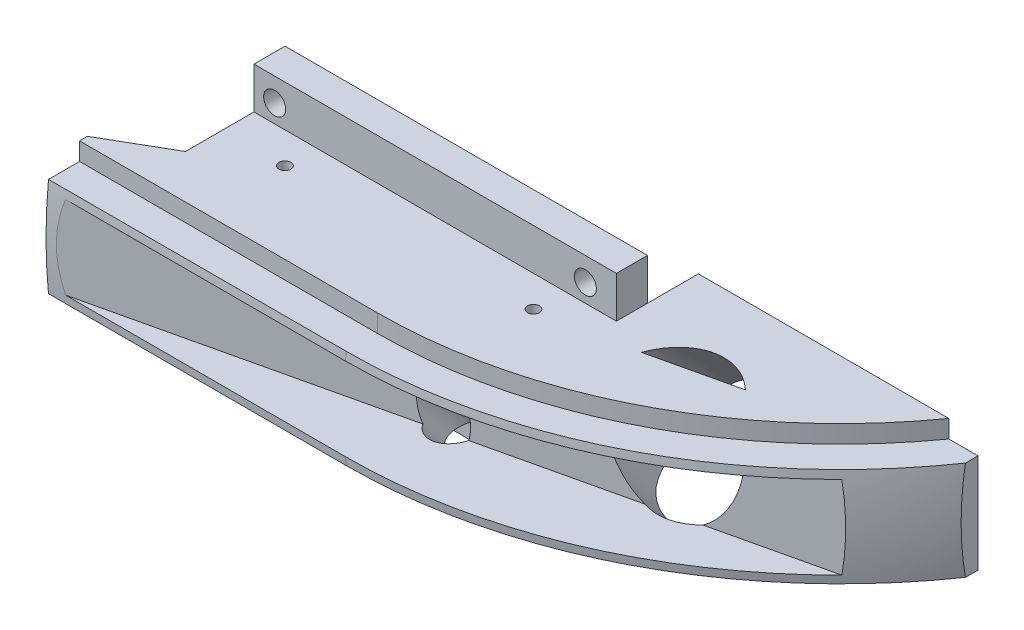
ISO-10303-21;
HEADER;
FILE_DESCRIPTION(('STEP AP214'),'2;1');
FILE_NAME('part.step','',(''),(''),'','','');
FILE_SCHEMA(('AUTOMOTIVE_DESIGN { 1 0 10303 214 1 1 1 1 }'));
ENDSEC;
DATA;
#1=APPLICATION_CONTEXT('core data for automotive mechanical design processes');
#2=APPLICATION_PROTOCOL_DEFINITION('international standard','automotive_design',2000,#1);
#3=PRODUCT_CONTEXT('',#1,'mechanical');
#4=PRODUCT('Part','Part','',(#3));
#5=PRODUCT_RELATED_PRODUCT_CATEGORY('part','',(#4));
#6=PRODUCT_DEFINITION_FORMATION('','',#4);
#7=PRODUCT_DEFINITION_CONTEXT('part definition',#1,'design');
#8=PRODUCT_DEFINITION('design','',#6,#7);
#9=PRODUCT_DEFINITION_SHAPE('','',#8);
#10=(LENGTH_UNIT() NAMED_UNIT(*) SI_UNIT(.MILLI.,.METRE.));
#11=(NAMED_UNIT(*) PLANE_ANGLE_UNIT() SI_UNIT($,.RADIAN.));
#12=(NAMED_UNIT(*) SI_UNIT($,.STERADIAN.) SOLID_ANGLE_UNIT());
#13=UNCERTAINTY_MEASURE_WITH_UNIT(LENGTH_MEASURE(1.E-05),#10,'distance_accuracy_value','');
#14=(GEOMETRIC_REPRESENTATION_CONTEXT(3) GLOBAL_UNCERTAINTY_ASSIGNED_CONTEXT((#13)) GLOBAL_UNIT_ASSIGNED_CONTEXT((#10,
#11,#12)) REPRESENTATION_CONTEXT('',''));
#15=CARTESIAN_POINT('',(0.,0.,0.));
#16=DIRECTION('',(0.,0.,1.));
#17=DIRECTION('',(1.,0.,0.));
#18=AXIS2_PLACEMENT_3D('',#15,#16,#17);
#19=CARTESIAN_POINT('',(119.85625,-20.6375,0.));
#20=DIRECTION('',(0.,1.,0.));
#21=DIRECTION('',(0.,0.,1.));
#22=AXIS2_PLACEMENT_3D('',#19,#20,#21);
#23=PLANE('',#22);
#24=CARTESIAN_POINT('',(142.875,-20.6375,117.2337));
#25=DIRECTION('',(0.,1.,0.));
#26=DIRECTION('',(0.,0.,1.));
#27=AXIS2_PLACEMENT_3D('',#24,#25,#26);
#28=CIRCLE('',#27,1.82879999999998);
#29=CARTESIAN_POINT('',(142.875,-20.6375,119.0625));
#30=VERTEX_POINT('',#29);
#31=EDGE_CURVE('E736',#30,#30,#28,.T.);
#32=ORIENTED_EDGE('',*,*,#31,.T.);
#33=EDGE_LOOP('',(#32));
#34=FACE_BOUND('',#33,.T.);
#35=CARTESIAN_POINT('',(66.6749999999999,-20.6375,117.2337));
#36=DIRECTION('',(0.,1.,0.));
#37=DIRECTION('',(0.,0.,1.));
#38=AXIS2_PLACEMENT_3D('',#35,#36,#37);
#39=CIRCLE('',#38,1.8288);
#40=CARTESIAN_POINT('',(66.6749999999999,-20.6375,119.0625));
#41=VERTEX_POINT('',#40);
#42=EDGE_CURVE('E722',#41,#41,#39,.T.);
#43=ORIENTED_EDGE('',*,*,#42,.T.);
#44=EDGE_LOOP('',(#43));
#45=FACE_BOUND('',#44,.T.);
#46=CARTESIAN_POINT('',(128.17475,-20.6375,118.77591706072));
#47=DIRECTION('',(0.,1.,0.));
#48=DIRECTION('',(0.,0.,-1.));
#49=AXIS2_PLACEMENT_3D('',#46,#47,#48);
#50=ELLIPSE('',#49,18.7893055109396,14.2875);
#51=CARTESIAN_POINT('',(114.801899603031,-20.6375,112.161208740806));
#52=VERTEX_POINT('',#51);
#53=CARTESIAN_POINT('',(116.635769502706,-20.6375,107.696));
#54=VERTEX_POINT('',#53);
#55=EDGE_CURVE('E341',#52,#54,#50,.F.);
#56=ORIENTED_EDGE('',*,*,#55,.F.);
#57=DIRECTION('',(1.,0.,0.));
#58=VECTOR('',#57,1.);
#59=CARTESIAN_POINT('',(119.85625,-20.6375,112.161208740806));
#60=LINE('',#59,#58);
#61=CARTESIAN_POINT('',(123.677996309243,-20.6375,112.161208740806));
#62=VERTEX_POINT('',#61);
#63=EDGE_CURVE('E345',#52,#62,#60,.T.);
#64=ORIENTED_EDGE('',*,*,#63,.T.);
#65=CARTESIAN_POINT('',(128.17475,-20.6375,118.77591706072));
#66=DIRECTION('',(0.,1.,0.));
#67=DIRECTION('',(0.,0.,-1.));
#68=AXIS2_PLACEMENT_3D('',#65,#66,#67);
#69=ELLIPSE('',#68,8.87272760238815,6.746875);
#70=CARTESIAN_POINT('',(132.671503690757,-20.6375,112.161208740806));
#71=VERTEX_POINT('',#70);
#72=EDGE_CURVE('E350',#71,#62,#69,.F.);
#73=ORIENTED_EDGE('',*,*,#72,.F.);
#74=CARTESIAN_POINT('',(141.547600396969,-20.6375,112.161208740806));
#75=VERTEX_POINT('',#74);
#76=EDGE_CURVE('E63',#71,#75,#60,.T.);
#77=ORIENTED_EDGE('',*,*,#76,.T.);
#78=CARTESIAN_POINT('',(139.713730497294,-20.6375,107.696));
#79=VERTEX_POINT('',#78);
#80=EDGE_CURVE('E331',#79,#75,#50,.F.);
#81=ORIENTED_EDGE('',*,*,#80,.F.);
#82=DIRECTION('',(-1.,0.,0.));
#83=VECTOR('',#82,1.);
#84=CARTESIAN_POINT('',(47.625,-20.6375,107.696));
#85=LINE('',#84,#83);
#86=CARTESIAN_POINT('',(158.75,-20.6375,107.696));
#87=VERTEX_POINT('',#86);
#88=EDGE_CURVE('E463',#87,#79,#85,.T.);
#89=ORIENTED_EDGE('',*,*,#88,.F.);
#90=DIRECTION('',(0.,0.,1.));
#91=VECTOR('',#90,1.);
#92=CARTESIAN_POINT('',(158.75,-20.6375,98.171));
#93=LINE('',#92,#91);
#94=CARTESIAN_POINT('',(158.75,-20.6375,98.171));
#95=VERTEX_POINT('',#94);
#96=EDGE_CURVE('E454',#95,#87,#93,.T.);
#97=ORIENTED_EDGE('',*,*,#96,.F.);
#98=DIRECTION('',(0.,0.,-1.));
#99=VECTOR('',#98,1.);
#100=CARTESIAN_POINT('',(158.75,-20.6375,98.171));
#101=LINE('',#100,#99);
#102=CARTESIAN_POINT('',(158.75,-20.6375,82.55));
#103=VERTEX_POINT('',#102);
#104=EDGE_CURVE('E479',#95,#103,#101,.T.);
#105=ORIENTED_EDGE('',*,*,#104,.T.);
#106=DIRECTION('',(-1.,0.,0.));
#107=VECTOR('',#106,1.);
#108=CARTESIAN_POINT('',(235.540597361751,-20.6375,82.55));
#109=LINE('',#108,#107);
#110=CARTESIAN_POINT('',(159.794921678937,-20.6375,82.55));
#111=VERTEX_POINT('',#110);
#112=EDGE_CURVE('E561',#111,#103,#109,.T.);
#113=ORIENTED_EDGE('',*,*,#112,.F.);
#114=CARTESIAN_POINT('',(178.50600030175,-20.6375,86.1475892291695));
#115=DIRECTION('',(0.,1.,0.));
#116=DIRECTION('',(0.224951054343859,0.,0.974370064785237));
#117=AXIS2_PLACEMENT_3D('',#114,#115,#116);
#118=ELLIPSE('',#117,25.8182363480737,18.25625);
#119=CARTESIAN_POINT('',(196.408070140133,-20.6375,82.55));
#120=VERTEX_POINT('',#119);
#121=EDGE_CURVE('E526',#111,#120,#118,.T.);
#122=ORIENTED_EDGE('',*,*,#121,.T.);
#123=CARTESIAN_POINT('',(235.540597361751,-20.6375,82.55));
#124=VERTEX_POINT('',#123);
#125=EDGE_CURVE('E577',#124,#120,#109,.T.);
#126=ORIENTED_EDGE('',*,*,#125,.F.);
#127=CARTESIAN_POINT('',(119.85625,-20.6375,0.));
#128=DIRECTION('',(0.,1.,0.));
#129=DIRECTION('',(0.,0.,1.));
#130=AXIS2_PLACEMENT_3D('',#127,#128,#129);
#131=CIRCLE('',#130,142.117453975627);
#132=CARTESIAN_POINT('',(119.85625,-20.6375,142.117453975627));
#133=VERTEX_POINT('',#132);
#134=EDGE_CURVE('E567',#133,#124,#131,.T.);
#135=ORIENTED_EDGE('',*,*,#134,.F.);
#136=DIRECTION('',(1.,0.,0.));
#137=VECTOR('',#136,1.);
#138=CARTESIAN_POINT('',(119.85625,-20.6375,142.117453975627));
#139=LINE('',#138,#137);
#140=CARTESIAN_POINT('',(28.575,-20.6375,142.117453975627));
#141=VERTEX_POINT('',#140);
#142=EDGE_CURVE('E584',#141,#133,#139,.T.);
#143=ORIENTED_EDGE('',*,*,#142,.F.);
#144=DIRECTION('',(0.,0.,1.));
#145=VECTOR('',#144,1.);
#146=CARTESIAN_POINT('',(28.575,-20.6375,142.117453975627));
#147=LINE('',#146,#145);
#148=CARTESIAN_POINT('',(28.575,-20.6375,139.7));
#149=VERTEX_POINT('',#148);
#150=EDGE_CURVE('E581',#149,#141,#147,.T.);
#151=ORIENTED_EDGE('',*,*,#150,.F.);
#152=DIRECTION('',(0.866025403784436,0.,-0.500000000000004));
#153=VECTOR('',#152,1.);
#154=CARTESIAN_POINT('',(47.625,-20.6375,128.701477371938));
#155=LINE('',#154,#153);
#156=CARTESIAN_POINT('',(47.625,-20.6375,128.701477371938));
#157=VERTEX_POINT('',#156);
#158=EDGE_CURVE('E489',#149,#157,#155,.T.);
#159=ORIENTED_EDGE('',*,*,#158,.T.);
#160=DIRECTION('',(0.,0.,-1.));
#161=VECTOR('',#160,1.);
#162=CARTESIAN_POINT('',(47.625,-20.6375,98.171));
#163=LINE('',#162,#161);
#164=CARTESIAN_POINT('',(47.625,-20.6375,107.696));
#165=VERTEX_POINT('',#164);
#166=EDGE_CURVE('E467',#157,#165,#163,.T.);
#167=ORIENTED_EDGE('',*,*,#166,.T.);
#168=EDGE_CURVE('E46',#54,#165,#85,.T.);
#169=ORIENTED_EDGE('',*,*,#168,.F.);
#170=EDGE_LOOP('',(#56,#64,#73,#77,#81,#89,#97,#105,#113,#122,#126,#135,#143,#151,#159,#167,#169));
#171=FACE_BOUND('',#170,.T.);
#172=ADVANCED_FACE('F42',(#34,#45,#171),#23,.F.);
#173=CARTESIAN_POINT('',(47.625,-33.3375,107.696));
#174=DIRECTION('',(0.,0.,-1.));
#175=DIRECTION('',(-1.,0.,0.));
#176=AXIS2_PLACEMENT_3D('',#173,#174,#175);
#177=PLANE('',#176);
#178=CARTESIAN_POINT('',(149.225,-26.19375,107.696));
#179=DIRECTION('',(0.,0.,1.));
#180=DIRECTION('',(1.,0.,0.));
#181=AXIS2_PLACEMENT_3D('',#178,#179,#180);
#182=CIRCLE('',#181,3.3782);
#183=CARTESIAN_POINT('',(152.6032,-26.19375,107.696));
#184=VERTEX_POINT('',#183);
#185=EDGE_CURVE('E388',#184,#184,#182,.T.);
#186=ORIENTED_EDGE('',*,*,#185,.F.);
#187=EDGE_LOOP('',(#186));
#188=FACE_BOUND('',#187,.T.);
#189=CARTESIAN_POINT('',(128.17475,-33.6104160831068,107.696));
#190=DIRECTION('',(0.,0.,-1.));
#191=DIRECTION('',(0.,-1.,0.));
#192=AXIS2_PLACEMENT_3D('',#189,#190,#191);
#193=ELLIPSE('',#192,21.9994502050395,14.2875);
#194=CARTESIAN_POINT('',(142.461150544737,-33.3375,107.696));
#195=VERTEX_POINT('',#194);
#196=EDGE_CURVE('E336',#195,#79,#193,.F.);
#197=ORIENTED_EDGE('',*,*,#196,.F.);
#198=DIRECTION('',(-1.,0.,0.));
#199=VECTOR('',#198,1.);
#200=CARTESIAN_POINT('',(47.625,-33.3375,107.696));
#201=LINE('',#200,#199);
#202=CARTESIAN_POINT('',(158.75,-33.3375,107.696));
#203=VERTEX_POINT('',#202);
#204=EDGE_CURVE('E445',#203,#195,#201,.T.);
#205=ORIENTED_EDGE('',*,*,#204,.F.);
#206=DIRECTION('',(0.,1.,0.));
#207=VECTOR('',#206,1.);
#208=CARTESIAN_POINT('',(158.75,-33.3375,107.696));
#209=LINE('',#208,#207);
#210=EDGE_CURVE('E459',#203,#87,#209,.T.);
#211=ORIENTED_EDGE('',*,*,#210,.T.);
#212=ORIENTED_EDGE('',*,*,#88,.T.);
#213=EDGE_LOOP('',(#197,#205,#211,#212));
#214=FACE_BOUND('',#213,.T.);
#215=ADVANCED_FACE('F828',(#188,#214),#177,.F.);
#216=CARTESIAN_POINT('',(53.975,-26.19375,107.696));
#217=DIRECTION('',(0.,0.,1.));
#218=DIRECTION('',(1.,0.,0.));
#219=AXIS2_PLACEMENT_3D('',#216,#217,#218);
#220=CIRCLE('',#219,3.37819999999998);
#221=CARTESIAN_POINT('',(57.3532,-26.19375,107.696));
#222=VERTEX_POINT('',#221);
#223=EDGE_CURVE('E381',#222,#222,#220,.T.);
#224=ORIENTED_EDGE('',*,*,#223,.F.);
#225=EDGE_LOOP('',(#224));
#226=FACE_BOUND('',#225,.T.);
#227=CARTESIAN_POINT('',(113.888349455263,-33.3375,107.696));
#228=VERTEX_POINT('',#227);
#229=EDGE_CURVE('E361',#54,#228,#193,.F.);
#230=ORIENTED_EDGE('',*,*,#229,.F.);
#231=ORIENTED_EDGE('',*,*,#168,.T.);
#232=DIRECTION('',(0.,1.,0.));
#233=VECTOR('',#232,1.);
#234=CARTESIAN_POINT('',(47.625,-33.3375,107.696));
#235=LINE('',#234,#233);
#236=CARTESIAN_POINT('',(47.625,-33.3375,107.696));
#237=VERTEX_POINT('',#236);
#238=EDGE_CURVE('E453',#237,#165,#235,.T.);
#239=ORIENTED_EDGE('',*,*,#238,.F.);
#240=EDGE_CURVE('E444',#228,#237,#201,.T.);
#241=ORIENTED_EDGE('',*,*,#240,.F.);
#242=EDGE_LOOP('',(#230,#231,#239,#241));
#243=FACE_BOUND('',#242,.T.);
#244=ADVANCED_FACE('F833',(#226,#243),#177,.F.);
#245=CARTESIAN_POINT('',(158.75,-33.3375,98.171));
#246=DIRECTION('',(0.,-1.,0.));
#247=DIRECTION('',(0.,0.,-1.));
#248=AXIS2_PLACEMENT_3D('',#245,#246,#247);
#249=PLANE('',#248);
#250=DIRECTION('',(1.,0.,0.));
#251=VECTOR('',#250,1.);
#252=CARTESIAN_POINT('',(47.625,-33.3375,98.171));
#253=LINE('',#252,#251);
#254=CARTESIAN_POINT('',(47.625,-33.3375,98.171));
#255=VERTEX_POINT('',#254);
#256=CARTESIAN_POINT('',(115.965139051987,-33.3375,98.171));
#257=VERTEX_POINT('',#256);
#258=EDGE_CURVE('E436',#255,#257,#253,.T.);
#259=ORIENTED_EDGE('',*,*,#258,.T.);
#260=CARTESIAN_POINT('',(128.17475,-33.3375,107.929092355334));
#261=DIRECTION('',(0.,-1.,0.));
#262=DIRECTION('',(0.,0.,-1.));
#263=AXIS2_PLACEMENT_3D('',#260,#261,#262);
#264=ELLIPSE('',#263,18.7893055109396,14.2875);
#265=EDGE_CURVE('E360',#257,#228,#264,.F.);
#266=ORIENTED_EDGE('',*,*,#265,.T.);
#267=ORIENTED_EDGE('',*,*,#240,.T.);
#268=DIRECTION('',(0.,0.,-1.));
#269=VECTOR('',#268,1.);
#270=CARTESIAN_POINT('',(47.625,-33.3375,98.171));
#271=LINE('',#270,#269);
#272=EDGE_CURVE('E449',#237,#255,#271,.T.);
#273=ORIENTED_EDGE('',*,*,#272,.T.);
#274=EDGE_LOOP('',(#259,#266,#267,#273));
#275=FACE_BOUND('',#274,.T.);
#276=ADVANCED_FACE('F1010',(#275),#249,.T.);
#277=ORIENTED_EDGE('',*,*,#204,.T.);
#278=CARTESIAN_POINT('',(140.384360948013,-33.3375,98.171));
#279=VERTEX_POINT('',#278);
#280=EDGE_CURVE('E355',#195,#279,#264,.F.);
#281=ORIENTED_EDGE('',*,*,#280,.T.);
#282=CARTESIAN_POINT('',(158.75,-33.3375,98.171));
#283=VERTEX_POINT('',#282);
#284=EDGE_CURVE('E441',#279,#283,#253,.T.);
#285=ORIENTED_EDGE('',*,*,#284,.T.);
#286=DIRECTION('',(0.,0.,1.));
#287=VECTOR('',#286,1.);
#288=CARTESIAN_POINT('',(158.75,-33.3375,98.171));
#289=LINE('',#288,#287);
#290=EDGE_CURVE('E440',#283,#203,#289,.T.);
#291=ORIENTED_EDGE('',*,*,#290,.T.);
#292=EDGE_LOOP('',(#277,#281,#285,#291));
#293=FACE_BOUND('',#292,.T.);
#294=ADVANCED_FACE('F864',(#293),#249,.T.);
#295=CARTESIAN_POINT('',(47.625,-20.6375,98.171));
#296=DIRECTION('',(0.,0.,1.));
#297=DIRECTION('',(1.,0.,0.));
#298=AXIS2_PLACEMENT_3D('',#295,#296,#297);
#299=PLANE('',#298);
#300=CARTESIAN_POINT('',(149.225,0.,98.171));
#301=DIRECTION('',(0.,0.,-1.));
#302=DIRECTION('',(-1.,0.,0.));
#303=AXIS2_PLACEMENT_3D('',#300,#301,#302);
#304=CIRCLE('',#303,2.0193);
#305=CARTESIAN_POINT('',(147.2057,0.,98.171));
#306=VERTEX_POINT('',#305);
#307=EDGE_CURVE('E401',#306,#306,#304,.T.);
#308=ORIENTED_EDGE('',*,*,#307,.F.);
#309=EDGE_LOOP('',(#308));
#310=FACE_BOUND('',#309,.T.);
#311=CARTESIAN_POINT('',(53.975,0.,98.171));
#312=DIRECTION('',(0.,0.,-1.));
#313=DIRECTION('',(-1.,0.,0.));
#314=AXIS2_PLACEMENT_3D('',#311,#312,#313);
#315=CIRCLE('',#314,2.0193);
#316=CARTESIAN_POINT('',(51.9557,0.,98.171));
#317=VERTEX_POINT('',#316);
#318=EDGE_CURVE('E393',#317,#317,#315,.T.);
#319=ORIENTED_EDGE('',*,*,#318,.F.);
#320=EDGE_LOOP('',(#319));
#321=FACE_BOUND('',#320,.T.);
#322=CARTESIAN_POINT('',(149.225,-26.19375,98.171));
#323=DIRECTION('',(0.,0.,1.));
#324=DIRECTION('',(1.,0.,0.));
#325=AXIS2_PLACEMENT_3D('',#322,#323,#324);
#326=CIRCLE('',#325,3.3782);
#327=CARTESIAN_POINT('',(152.6032,-26.19375,98.171));
#328=VERTEX_POINT('',#327);
#329=EDGE_CURVE('E392',#328,#328,#326,.T.);
#330=ORIENTED_EDGE('',*,*,#329,.T.);
#331=EDGE_LOOP('',(#330));
#332=FACE_BOUND('',#331,.T.);
#333=CARTESIAN_POINT('',(53.975,-26.19375,98.171));
#334=DIRECTION('',(0.,0.,1.));
#335=DIRECTION('',(1.,0.,0.));
#336=AXIS2_PLACEMENT_3D('',#333,#334,#335);
#337=CIRCLE('',#336,3.37819999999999);
#338=CARTESIAN_POINT('',(57.3532,-26.19375,98.171));
#339=VERTEX_POINT('',#338);
#340=EDGE_CURVE('E384',#339,#339,#337,.T.);
#341=ORIENTED_EDGE('',*,*,#340,.T.);
#342=EDGE_LOOP('',(#341));
#343=FACE_BOUND('',#342,.T.);
#344=CARTESIAN_POINT('',(149.225,26.19375,98.171));
#345=DIRECTION('',(0.,0.,1.));
#346=DIRECTION('',(1.,0.,0.));
#347=AXIS2_PLACEMENT_3D('',#344,#345,#346);
#348=CIRCLE('',#347,3.3782);
#349=CARTESIAN_POINT('',(152.6032,26.19375,98.171));
#350=VERTEX_POINT('',#349);
#351=EDGE_CURVE('E380',#350,#350,#348,.T.);
#352=ORIENTED_EDGE('',*,*,#351,.T.);
#353=EDGE_LOOP('',(#352));
#354=FACE_BOUND('',#353,.T.);
#355=CARTESIAN_POINT('',(53.975,26.19375,98.171));
#356=DIRECTION('',(0.,0.,1.));
#357=DIRECTION('',(1.,0.,0.));
#358=AXIS2_PLACEMENT_3D('',#355,#356,#357);
#359=CIRCLE('',#358,3.37819999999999);
#360=CARTESIAN_POINT('',(57.3532,26.19375,98.171));
#361=VERTEX_POINT('',#360);
#362=EDGE_CURVE('E375',#361,#361,#359,.T.);
#363=ORIENTED_EDGE('',*,*,#362,.T.);
#364=EDGE_LOOP('',(#363));
#365=FACE_BOUND('',#364,.T.);
#366=CARTESIAN_POINT('',(128.17475,-44.7627582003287,98.171));
#367=DIRECTION('',(0.,0.,1.));
#368=DIRECTION('',(0.,-1.,0.));
#369=AXIS2_PLACEMENT_3D('',#366,#367,#368);
#370=ELLIPSE('',#369,21.9994502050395,14.2875);
#371=EDGE_CURVE('E11',#257,#279,#370,.F.);
#372=ORIENTED_EDGE('',*,*,#371,.F.);
#373=ORIENTED_EDGE('',*,*,#258,.F.);
#374=DIRECTION('',(0.,1.,0.));
#375=VECTOR('',#374,1.);
#376=CARTESIAN_POINT('',(47.625,-20.6375,98.171));
#377=LINE('',#376,#375);
#378=CARTESIAN_POINT('',(47.625,33.3375,98.171));
#379=VERTEX_POINT('',#378);
#380=EDGE_CURVE('E494',#255,#379,#377,.T.);
#381=ORIENTED_EDGE('',*,*,#380,.T.);
#382=DIRECTION('',(-1.,0.,0.));
#383=VECTOR('',#382,1.);
#384=CARTESIAN_POINT('',(47.625,33.3375,98.171));
#385=LINE('',#384,#383);
#386=CARTESIAN_POINT('',(158.75,33.3375,98.171));
#387=VERTEX_POINT('',#386);
#388=EDGE_CURVE('E410',#387,#379,#385,.T.);
#389=ORIENTED_EDGE('',*,*,#388,.F.);
#390=DIRECTION('',(0.,-1.,0.));
#391=VECTOR('',#390,1.);
#392=CARTESIAN_POINT('',(158.75,33.3375,98.171));
#393=LINE('',#392,#391);
#394=CARTESIAN_POINT('',(158.75,20.6375,98.171));
#395=VERTEX_POINT('',#394);
#396=EDGE_CURVE('E424',#387,#395,#393,.T.);
#397=ORIENTED_EDGE('',*,*,#396,.T.);
#398=DIRECTION('',(0.,1.,0.));
#399=VECTOR('',#398,1.);
#400=CARTESIAN_POINT('',(158.75,-20.6375,98.171));
#401=LINE('',#400,#399);
#402=EDGE_CURVE('E508',#95,#395,#401,.T.);
#403=ORIENTED_EDGE('',*,*,#402,.F.);
#404=DIRECTION('',(0.,1.,0.));
#405=VECTOR('',#404,1.);
#406=CARTESIAN_POINT('',(158.75,-33.3375,98.171));
#407=LINE('',#406,#405);
#408=EDGE_CURVE('E723',#283,#95,#407,.T.);
#409=ORIENTED_EDGE('',*,*,#408,.F.);
#410=ORIENTED_EDGE('',*,*,#284,.F.);
#411=EDGE_LOOP('',(#372,#373,#381,#389,#397,#403,#409,#410));
#412=FACE_BOUND('',#411,.T.);
#413=ADVANCED_FACE('F874',(#310,#321,#332,#343,#354,#365,#412),#299,.F.);
#414=CARTESIAN_POINT('',(31.75,-12.7,152.4));
#415=DIRECTION('',(-0.224951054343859,0.,-0.974370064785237));
#416=DIRECTION('',(-0.974370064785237,0.,0.224951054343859));
#417=AXIS2_PLACEMENT_3D('',#414,#415,#416);
#418=PLANE('',#417);
#419=CARTESIAN_POINT('',(128.17475,-7.33351652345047,130.138592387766));
#420=DIRECTION('',(-0.224951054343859,0.,-0.974370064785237));
#421=DIRECTION('',(0.183839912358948,-0.982039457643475,-0.0424427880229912));
#422=AXIS2_PLACEMENT_3D('',#419,#420,#421);
#423=ELLIPSE('',#422,10.6618928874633,6.746875);
#424=CARTESIAN_POINT('',(134.48913276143,-12.7,128.68080226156));
#425=VERTEX_POINT('',#424);
#426=CARTESIAN_POINT('',(123.047478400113,-12.7,131.322316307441));
#427=VERTEX_POINT('',#426);
#428=EDGE_CURVE('E73',#425,#427,#423,.F.);
#429=ORIENTED_EDGE('',*,*,#428,.F.);
#430=DIRECTION('',(-0.974370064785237,0.,0.224951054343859));
#431=VECTOR('',#430,1.);
#432=CARTESIAN_POINT('',(31.75,-12.7,152.4));
#433=LINE('',#432,#431);
#434=CARTESIAN_POINT('',(178.39374484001,-12.7,118.544623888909));
#435=VERTEX_POINT('',#434);
#436=EDGE_CURVE('E544',#435,#425,#433,.T.);
#437=ORIENTED_EDGE('',*,*,#436,.F.);
#438=CARTESIAN_POINT('',(185.601282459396,10.9039487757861,116.880632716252));
#439=DIRECTION('',(-0.224951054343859,0.,-0.974370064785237));
#440=DIRECTION('',(0.,1.,0.));
#441=AXIS2_PLACEMENT_3D('',#438,#439,#440);
#442=ELLIPSE('',#441,25.8182363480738,18.25625);
#443=CARTESIAN_POINT('',(167.856032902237,12.7,120.977446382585));
#444=VERTEX_POINT('',#443);
#445=EDGE_CURVE('E521',#435,#444,#442,.T.);
#446=ORIENTED_EDGE('',*,*,#445,.T.);
#447=DIRECTION('',(-0.974370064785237,0.,0.224951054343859));
#448=VECTOR('',#447,1.);
#449=CARTESIAN_POINT('',(31.75,12.7,152.4));
#450=LINE('',#449,#448);
#451=CARTESIAN_POINT('',(34.046065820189,12.7,151.869911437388));
#452=VERTEX_POINT('',#451);
#453=EDGE_CURVE('E538',#444,#452,#450,.T.);
#454=ORIENTED_EDGE('',*,*,#453,.T.);
#455=CARTESIAN_POINT('',(691.866923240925,0.,0.));
#456=DIRECTION('',(-0.224951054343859,0.,-0.974370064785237));
#457=DIRECTION('',(-0.974370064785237,0.,0.224951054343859));
#458=AXIS2_PLACEMENT_3D('',#455,#456,#457);
#459=ELLIPSE('',#458,677.480709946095,152.4);
#460=CARTESIAN_POINT('',(34.046065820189,-12.7,151.869911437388));
#461=VERTEX_POINT('',#460);
#462=EDGE_CURVE('E676',#461,#452,#459,.T.);
#463=ORIENTED_EDGE('',*,*,#462,.F.);
#464=EDGE_CURVE('E545',#427,#461,#433,.T.);
#465=ORIENTED_EDGE('',*,*,#464,.F.);
#466=EDGE_LOOP('',(#429,#437,#446,#454,#463,#465));
#467=FACE_BOUND('',#466,.T.);
#468=ADVANCED_FACE('F771',(#467),#418,.F.);
#469=CARTESIAN_POINT('',(244.475000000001,-12.7,152.4));
#470=DIRECTION('',(0.,1.,0.));
#471=DIRECTION('',(0.,0.,1.));
#472=AXIS2_PLACEMENT_3D('',#469,#470,#471);
#473=PLANE('',#472);
#474=ORIENTED_EDGE('',*,*,#436,.T.);
#475=CARTESIAN_POINT('',(128.17475,-12.7,125.555182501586));
#476=DIRECTION('',(0.,1.,0.));
#477=DIRECTION('',(0.,0.,-1.));
#478=AXIS2_PLACEMENT_3D('',#475,#476,#477);
#479=ELLIPSE('',#478,8.87272760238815,6.746875);
#480=EDGE_CURVE('E340',#425,#427,#479,.F.);
#481=ORIENTED_EDGE('',*,*,#480,.T.);
#482=ORIENTED_EDGE('',*,*,#464,.T.);
#483=DIRECTION('',(-1.,0.,0.));
#484=VECTOR('',#483,1.);
#485=CARTESIAN_POINT('',(0.,-12.7,151.869911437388));
#486=LINE('',#485,#484);
#487=CARTESIAN_POINT('',(119.85625,-12.7,151.869911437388));
#488=VERTEX_POINT('',#487);
#489=EDGE_CURVE('E679',#461,#488,#486,.F.);
#490=ORIENTED_EDGE('',*,*,#489,.T.);
#491=CARTESIAN_POINT('',(119.85625,-12.7,0.));
#492=DIRECTION('',(0.,1.,0.));
#493=DIRECTION('',(0.,0.,1.));
#494=AXIS2_PLACEMENT_3D('',#491,#492,#493);
#495=CIRCLE('',#494,151.869911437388);
#496=CARTESIAN_POINT('',(227.402428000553,-12.7,107.230077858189));
#497=VERTEX_POINT('',#496);
#498=EDGE_CURVE('E554',#488,#497,#495,.T.);
#499=ORIENTED_EDGE('',*,*,#498,.T.);
#500=CARTESIAN_POINT('',(192.808820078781,-12.7,115.216641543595));
#501=VERTEX_POINT('',#500);
#502=EDGE_CURVE('E539',#497,#501,#433,.T.);
#503=ORIENTED_EDGE('',*,*,#502,.T.);
#504=CARTESIAN_POINT('',(180.291549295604,-12.7,93.8816516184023));
#505=DIRECTION('',(0.,1.,0.));
#506=DIRECTION('',(0.224951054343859,0.,0.974370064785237));
#507=AXIS2_PLACEMENT_3D('',#504,#505,#506);
#508=ELLIPSE('',#507,25.8182363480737,18.25625);
#509=EDGE_CURVE('E518',#435,#501,#508,.T.);
#510=ORIENTED_EDGE('',*,*,#509,.F.);
#511=EDGE_LOOP('',(#474,#481,#482,#490,#499,#503,#510));
#512=FACE_BOUND('',#511,.T.);
#513=ADVANCED_FACE('F769',(#512),#473,.T.);
#514=CARTESIAN_POINT('',(227.402428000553,12.7,107.230077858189));
#515=VERTEX_POINT('',#514);
#516=CARTESIAN_POINT('',(203.346532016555,12.7,112.783819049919));
#517=VERTEX_POINT('',#516);
#518=EDGE_CURVE('E546',#515,#517,#450,.T.);
#519=ORIENTED_EDGE('',*,*,#518,.T.);
#520=EDGE_CURVE('E525',#517,#501,#442,.T.);
#521=ORIENTED_EDGE('',*,*,#520,.T.);
#522=ORIENTED_EDGE('',*,*,#502,.F.);
#523=CARTESIAN_POINT('',(148.8016928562,0.,125.376487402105));
#524=DIRECTION('',(-0.224951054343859,0.,-0.974370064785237));
#525=DIRECTION('',(-0.974370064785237,0.,0.224951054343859));
#526=AXIS2_PLACEMENT_3D('',#523,#524,#525);
#527=CIRCLE('',#526,81.6618499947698);
#528=EDGE_CURVE('E557',#515,#497,#527,.T.);
#529=ORIENTED_EDGE('',*,*,#528,.F.);
#530=EDGE_LOOP('',(#519,#521,#522,#529));
#531=FACE_BOUND('',#530,.T.);
#532=ADVANCED_FACE('F844',(#531),#418,.F.);
#533=CARTESIAN_POINT('',(119.85625,0.,0.));
#534=DIRECTION('',(-1.,0.,0.));
#535=DIRECTION('',(0.,0.,1.));
#536=AXIS2_PLACEMENT_3D('',#533,#534,#535);
#537=SPHERICAL_SURFACE('',#536,152.4);
#538=ORIENTED_EDGE('',*,*,#498,.F.);
#539=CARTESIAN_POINT('',(119.85625,0.,0.));
#540=DIRECTION('',(-1.,0.,0.));
#541=DIRECTION('',(0.,0.,1.));
#542=AXIS2_PLACEMENT_3D('',#539,#540,#541);
#543=CIRCLE('',#542,152.4);
#544=CARTESIAN_POINT('',(119.85625,-15.1765,151.642453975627));
#545=VERTEX_POINT('',#544);
#546=EDGE_CURVE('E618',#545,#488,#543,.T.);
#547=ORIENTED_EDGE('',*,*,#546,.F.);
#548=CARTESIAN_POINT('',(119.85625,-15.1765,0.));
#549=DIRECTION('',(0.,1.,0.));
#550=DIRECTION('',(0.,0.,1.));
#551=AXIS2_PLACEMENT_3D('',#548,#549,#550);
#552=CIRCLE('',#551,151.642453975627);
#553=CARTESIAN_POINT('',(244.475000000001,-15.1765,86.403709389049));
#554=VERTEX_POINT('',#553);
#555=EDGE_CURVE('E634',#554,#545,#552,.F.);
#556=ORIENTED_EDGE('',*,*,#555,.F.);
#557=CARTESIAN_POINT('',(244.475000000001,0.,0.));
#558=DIRECTION('',(-1.,0.,0.));
#559=DIRECTION('',(0.,0.,1.));
#560=AXIS2_PLACEMENT_3D('',#557,#558,#559);
#561=CIRCLE('',#560,87.7264335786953);
#562=CARTESIAN_POINT('',(244.475000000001,15.1765,86.403709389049));
#563=VERTEX_POINT('',#562);
#564=EDGE_CURVE('E664',#563,#554,#561,.F.);
#565=ORIENTED_EDGE('',*,*,#564,.F.);
#566=CARTESIAN_POINT('',(119.85625,15.1765,0.));
#567=DIRECTION('',(0.,-1.,0.));
#568=DIRECTION('',(0.,0.,-1.));
#569=AXIS2_PLACEMENT_3D('',#566,#567,#568);
#570=CIRCLE('',#569,151.642453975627);
#571=CARTESIAN_POINT('',(119.85625,15.1765,151.642453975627));
#572=VERTEX_POINT('',#571);
#573=EDGE_CURVE('E630',#572,#563,#570,.F.);
#574=ORIENTED_EDGE('',*,*,#573,.F.);
#575=CARTESIAN_POINT('',(119.85625,12.7,151.869911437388));
#576=VERTEX_POINT('',#575);
#577=EDGE_CURVE('E617',#576,#572,#543,.T.);
#578=ORIENTED_EDGE('',*,*,#577,.F.);
#579=CARTESIAN_POINT('',(119.85625,12.7,0.));
#580=DIRECTION('',(0.,1.,0.));
#581=DIRECTION('',(0.,0.,1.));
#582=AXIS2_PLACEMENT_3D('',#579,#580,#581);
#583=CIRCLE('',#582,151.869911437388);
#584=EDGE_CURVE('E543',#576,#515,#583,.T.);
#585=ORIENTED_EDGE('',*,*,#584,.T.);
#586=ORIENTED_EDGE('',*,*,#528,.T.);
#587=EDGE_LOOP('',(#538,#547,#556,#565,#574,#578,#585,#586));
#588=FACE_BOUND('',#587,.T.);
#589=ADVANCED_FACE('F778',(#588),#537,.T.);
#590=CARTESIAN_POINT('',(244.475000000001,-15.1765,82.55));
#591=DIRECTION('',(0.,1.,0.));
#592=DIRECTION('',(0.,0.,1.));
#593=AXIS2_PLACEMENT_3D('',#590,#591,#592);
#594=PLANE('',#593);
#595=DIRECTION('',(-1.,0.,0.));
#596=VECTOR('',#595,1.);
#597=CARTESIAN_POINT('',(244.475000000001,-15.1765,142.117453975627));
#598=LINE('',#597,#596);
#599=CARTESIAN_POINT('',(119.85625,-15.1765,142.117453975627));
#600=VERTEX_POINT('',#599);
#601=CARTESIAN_POINT('',(28.575,-15.1765,142.117453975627));
#602=VERTEX_POINT('',#601);
#603=EDGE_CURVE('E609',#600,#602,#598,.T.);
#604=ORIENTED_EDGE('',*,*,#603,.F.);
#605=CARTESIAN_POINT('',(119.85625,-15.1765,0.));
#606=DIRECTION('',(0.,1.,0.));
#607=DIRECTION('',(0.,0.,1.));
#608=AXIS2_PLACEMENT_3D('',#605,#606,#607);
#609=CIRCLE('',#608,142.117453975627);
#610=CARTESIAN_POINT('',(235.540597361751,-15.1765,82.55));
#611=VERTEX_POINT('',#610);
#612=EDGE_CURVE('E613',#611,#600,#609,.F.);
#613=ORIENTED_EDGE('',*,*,#612,.F.);
#614=DIRECTION('',(-1.,0.,0.));
#615=VECTOR('',#614,1.);
#616=CARTESIAN_POINT('',(244.475000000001,-15.1765,82.55));
#617=LINE('',#616,#615);
#618=CARTESIAN_POINT('',(244.475000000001,-15.1765,82.55));
#619=VERTEX_POINT('',#618);
#620=EDGE_CURVE('E657',#619,#611,#617,.T.);
#621=ORIENTED_EDGE('',*,*,#620,.F.);
#622=DIRECTION('',(0.,0.,-1.));
#623=VECTOR('',#622,1.);
#624=CARTESIAN_POINT('',(244.475000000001,-15.1765,82.55));
#625=LINE('',#624,#623);
#626=EDGE_CURVE('E639',#554,#619,#625,.T.);
#627=ORIENTED_EDGE('',*,*,#626,.F.);
#628=ORIENTED_EDGE('',*,*,#555,.T.);
#629=DIRECTION('',(-1.,0.,0.));
#630=VECTOR('',#629,1.);
#631=CARTESIAN_POINT('',(0.,-15.1765,151.642453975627));
#632=LINE('',#631,#630);
#633=CARTESIAN_POINT('',(28.575,-15.1765,151.642453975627));
#634=VERTEX_POINT('',#633);
#635=EDGE_CURVE('E626',#545,#634,#632,.T.);
#636=ORIENTED_EDGE('',*,*,#635,.T.);
#637=DIRECTION('',(0.,0.,-1.));
#638=VECTOR('',#637,1.);
#639=CARTESIAN_POINT('',(28.575,-15.1765,82.55));
#640=LINE('',#639,#638);
#641=EDGE_CURVE('E638',#634,#602,#640,.T.);
#642=ORIENTED_EDGE('',*,*,#641,.T.);
#643=EDGE_LOOP('',(#604,#613,#621,#627,#628,#636,#642));
#644=FACE_BOUND('',#643,.T.);
#645=ADVANCED_FACE('F44',(#644),#594,.F.);
#646=CARTESIAN_POINT('',(244.475000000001,15.1765,152.4));
#647=DIRECTION('',(0.,-1.,0.));
#648=DIRECTION('',(0.,0.,-1.));
#649=AXIS2_PLACEMENT_3D('',#646,#647,#648);
#650=PLANE('',#649);
#651=DIRECTION('',(1.,0.,0.));
#652=VECTOR('',#651,1.);
#653=CARTESIAN_POINT('',(244.475000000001,15.1765,142.117453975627));
#654=LINE('',#653,#652);
#655=CARTESIAN_POINT('',(28.575,15.1765,142.117453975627));
#656=VERTEX_POINT('',#655);
#657=CARTESIAN_POINT('',(119.85625,15.1765,142.117453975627));
#658=VERTEX_POINT('',#657);
#659=EDGE_CURVE('E605',#656,#658,#654,.T.);
#660=ORIENTED_EDGE('',*,*,#659,.F.);
#661=DIRECTION('',(0.,0.,1.));
#662=VECTOR('',#661,1.);
#663=CARTESIAN_POINT('',(28.575,15.1765,152.4));
#664=LINE('',#663,#662);
#665=CARTESIAN_POINT('',(28.575,15.1765,151.642453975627));
#666=VERTEX_POINT('',#665);
#667=EDGE_CURVE('E643',#656,#666,#664,.T.);
#668=ORIENTED_EDGE('',*,*,#667,.T.);
#669=DIRECTION('',(-1.,0.,0.));
#670=VECTOR('',#669,1.);
#671=CARTESIAN_POINT('',(0.,15.1765,151.642453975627));
#672=LINE('',#671,#670);
#673=EDGE_CURVE('E622',#666,#572,#672,.F.);
#674=ORIENTED_EDGE('',*,*,#673,.T.);
#675=ORIENTED_EDGE('',*,*,#573,.T.);
#676=DIRECTION('',(0.,0.,1.));
#677=VECTOR('',#676,1.);
#678=CARTESIAN_POINT('',(244.475000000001,15.1765,152.4));
#679=LINE('',#678,#677);
#680=CARTESIAN_POINT('',(244.475000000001,15.1765,82.55));
#681=VERTEX_POINT('',#680);
#682=EDGE_CURVE('E646',#681,#563,#679,.T.);
#683=ORIENTED_EDGE('',*,*,#682,.F.);
#684=DIRECTION('',(-1.,0.,0.));
#685=VECTOR('',#684,1.);
#686=CARTESIAN_POINT('',(244.475000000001,15.1765,82.55));
#687=LINE('',#686,#685);
#688=CARTESIAN_POINT('',(235.540597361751,15.1765,82.55));
#689=VERTEX_POINT('',#688);
#690=EDGE_CURVE('E650',#681,#689,#687,.T.);
#691=ORIENTED_EDGE('',*,*,#690,.T.);
#692=CARTESIAN_POINT('',(119.85625,15.1765,0.));
#693=DIRECTION('',(0.,-1.,0.));
#694=DIRECTION('',(0.,0.,-1.));
#695=AXIS2_PLACEMENT_3D('',#692,#693,#694);
#696=CIRCLE('',#695,142.117453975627);
#697=EDGE_CURVE('E668',#658,#689,#696,.F.);
#698=ORIENTED_EDGE('',*,*,#697,.F.);
#699=EDGE_LOOP('',(#660,#668,#674,#675,#683,#691,#698));
#700=FACE_BOUND('',#699,.T.);
#701=ADVANCED_FACE('F790',(#700),#650,.F.);
#702=CARTESIAN_POINT('',(244.475000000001,15.1765,82.55));
#703=DIRECTION('',(0.,0.,1.));
#704=DIRECTION('',(1.,0.,0.));
#705=AXIS2_PLACEMENT_3D('',#702,#703,#704);
#706=PLANE('',#705);
#707=ORIENTED_EDGE('',*,*,#112,.T.);
#708=DIRECTION('',(0.,1.,0.));
#709=VECTOR('',#708,1.);
#710=CARTESIAN_POINT('',(158.75,-20.6375,82.55));
#711=LINE('',#710,#709);
#712=CARTESIAN_POINT('',(158.75,20.6375,82.55));
#713=VERTEX_POINT('',#712);
#714=EDGE_CURVE('E504',#103,#713,#711,.T.);
#715=ORIENTED_EDGE('',*,*,#714,.T.);
#716=DIRECTION('',(-1.,0.,0.));
#717=VECTOR('',#716,1.);
#718=CARTESIAN_POINT('',(235.540597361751,20.6375,82.55));
#719=LINE('',#718,#717);
#720=CARTESIAN_POINT('',(235.540597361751,20.6375,82.55));
#721=VERTEX_POINT('',#720);
#722=EDGE_CURVE('E562',#721,#713,#719,.T.);
#723=ORIENTED_EDGE('',*,*,#722,.F.);
#724=DIRECTION('',(0.,-1.,0.));
#725=VECTOR('',#724,1.);
#726=CARTESIAN_POINT('',(235.540597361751,20.6375,82.55));
#727=LINE('',#726,#725);
#728=EDGE_CURVE('E591',#721,#689,#727,.T.);
#729=ORIENTED_EDGE('',*,*,#728,.T.);
#730=ORIENTED_EDGE('',*,*,#690,.F.);
#731=DIRECTION('',(0.,1.,0.));
#732=VECTOR('',#731,1.);
#733=CARTESIAN_POINT('',(244.475000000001,15.1765,82.55));
#734=LINE('',#733,#732);
#735=EDGE_CURVE('E642',#619,#681,#734,.T.);
#736=ORIENTED_EDGE('',*,*,#735,.F.);
#737=ORIENTED_EDGE('',*,*,#620,.T.);
#738=EDGE_CURVE('E576',#611,#124,#727,.T.);
#739=ORIENTED_EDGE('',*,*,#738,.T.);
#740=ORIENTED_EDGE('',*,*,#125,.T.);
#741=CARTESIAN_POINT('',(177.675431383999,-24.3297206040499,82.55));
#742=DIRECTION('',(0.,0.,1.));
#743=DIRECTION('',(0.219466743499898,0.975619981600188,0.));
#744=AXIS2_PLACEMENT_3D('',#741,#742,#743);
#745=ELLIPSE('',#744,26.4973620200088,18.25625);
#746=EDGE_CURVE('E530',#120,#111,#745,.T.);
#747=ORIENTED_EDGE('',*,*,#746,.T.);
#748=EDGE_LOOP('',(#707,#715,#723,#729,#730,#736,#737,#739,#740,#747));
#749=FACE_BOUND('',#748,.T.);
#750=ADVANCED_FACE('F847',(#749),#706,.F.);
#751=CARTESIAN_POINT('',(244.475000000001,15.1765,152.4));
#752=DIRECTION('',(-1.,0.,0.));
#753=DIRECTION('',(0.,0.,1.));
#754=AXIS2_PLACEMENT_3D('',#751,#752,#753);
#755=PLANE('',#754);
#756=ORIENTED_EDGE('',*,*,#682,.T.);
#757=ORIENTED_EDGE('',*,*,#564,.T.);
#758=ORIENTED_EDGE('',*,*,#626,.T.);
#759=ORIENTED_EDGE('',*,*,#735,.T.);
#760=EDGE_LOOP('',(#756,#757,#758,#759));
#761=FACE_BOUND('',#760,.T.);
#762=ADVANCED_FACE('F784',(#761),#755,.F.);
#763=CARTESIAN_POINT('',(28.575,15.1765,152.4));
#764=DIRECTION('',(-1.,0.,0.));
#765=DIRECTION('',(0.,0.,1.));
#766=AXIS2_PLACEMENT_3D('',#763,#764,#765);
#767=PLANE('',#766);
#768=DIRECTION('',(0.,1.,0.));
#769=VECTOR('',#768,1.);
#770=CARTESIAN_POINT('',(28.575,-20.6375,139.7));
#771=LINE('',#770,#769);
#772=CARTESIAN_POINT('',(28.575,20.6375,139.7));
#773=VERTEX_POINT('',#772);
#774=EDGE_CURVE('E501',#149,#773,#771,.T.);
#775=ORIENTED_EDGE('',*,*,#774,.F.);
#776=ORIENTED_EDGE('',*,*,#150,.T.);
#777=DIRECTION('',(0.,-1.,0.));
#778=VECTOR('',#777,1.);
#779=CARTESIAN_POINT('',(28.575,20.6375,142.117453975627));
#780=LINE('',#779,#778);
#781=EDGE_CURVE('E600',#602,#141,#780,.T.);
#782=ORIENTED_EDGE('',*,*,#781,.F.);
#783=ORIENTED_EDGE('',*,*,#641,.F.);
#784=CARTESIAN_POINT('',(28.575,0.,0.));
#785=DIRECTION('',(-1.,0.,0.));
#786=DIRECTION('',(0.,0.,1.));
#787=AXIS2_PLACEMENT_3D('',#784,#785,#786);
#788=CIRCLE('',#787,152.4);
#789=EDGE_CURVE('E661',#666,#634,#788,.F.);
#790=ORIENTED_EDGE('',*,*,#789,.F.);
#791=ORIENTED_EDGE('',*,*,#667,.F.);
#792=CARTESIAN_POINT('',(28.575,20.6375,142.117453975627));
#793=VERTEX_POINT('',#792);
#794=EDGE_CURVE('E601',#793,#656,#780,.T.);
#795=ORIENTED_EDGE('',*,*,#794,.F.);
#796=DIRECTION('',(0.,0.,1.));
#797=VECTOR('',#796,1.);
#798=CARTESIAN_POINT('',(28.575,20.6375,142.117453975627));
#799=LINE('',#798,#797);
#800=EDGE_CURVE('E566',#773,#793,#799,.T.);
#801=ORIENTED_EDGE('',*,*,#800,.F.);
#802=EDGE_LOOP('',(#775,#776,#782,#783,#790,#791,#795,#801));
#803=FACE_BOUND('',#802,.T.);
#804=ADVANCED_FACE('F748',(#803),#767,.T.);
#805=CARTESIAN_POINT('',(0.,0.,0.));
#806=DIRECTION('',(-1.,0.,0.));
#807=DIRECTION('',(0.,0.,1.));
#808=AXIS2_PLACEMENT_3D('',#805,#806,#807);
#809=CYLINDRICAL_SURFACE('',#808,152.4);
#810=ORIENTED_EDGE('',*,*,#489,.F.);
#811=ORIENTED_EDGE('',*,*,#462,.T.);
#812=DIRECTION('',(-1.,0.,0.));
#813=VECTOR('',#812,1.);
#814=CARTESIAN_POINT('',(0.,12.7,151.869911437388));
#815=LINE('',#814,#813);
#816=EDGE_CURVE('E672',#452,#576,#815,.F.);
#817=ORIENTED_EDGE('',*,*,#816,.T.);
#818=ORIENTED_EDGE('',*,*,#577,.T.);
#819=ORIENTED_EDGE('',*,*,#673,.F.);
#820=ORIENTED_EDGE('',*,*,#789,.T.);
#821=ORIENTED_EDGE('',*,*,#635,.F.);
#822=ORIENTED_EDGE('',*,*,#546,.T.);
#823=EDGE_LOOP('',(#810,#811,#817,#818,#819,#820,#821,#822));
#824=FACE_BOUND('',#823,.T.);
#825=ADVANCED_FACE('F775',(#824),#809,.T.);
#826=CARTESIAN_POINT('',(119.85625,20.6375,0.));
#827=DIRECTION('',(0.,1.,0.));
#828=DIRECTION('',(0.,0.,1.));
#829=AXIS2_PLACEMENT_3D('',#826,#827,#828);
#830=PLANE('',#829);
#831=DIRECTION('',(0.,0.,-1.));
#832=VECTOR('',#831,1.);
#833=CARTESIAN_POINT('',(158.75,20.6375,98.171));
#834=LINE('',#833,#832);
#835=CARTESIAN_POINT('',(158.75,20.6375,107.696));
#836=VERTEX_POINT('',#835);
#837=EDGE_CURVE('E415',#836,#395,#834,.T.);
#838=ORIENTED_EDGE('',*,*,#837,.F.);
#839=DIRECTION('',(1.,0.,0.));
#840=VECTOR('',#839,1.);
#841=CARTESIAN_POINT('',(47.625,20.6375,107.696));
#842=LINE('',#841,#840);
#843=CARTESIAN_POINT('',(47.625,20.6375,107.696));
#844=VERTEX_POINT('',#843);
#845=EDGE_CURVE('E409',#844,#836,#842,.T.);
#846=ORIENTED_EDGE('',*,*,#845,.F.);
#847=DIRECTION('',(0.,0.,-1.));
#848=VECTOR('',#847,1.);
#849=CARTESIAN_POINT('',(47.625,20.6375,98.171));
#850=LINE('',#849,#848);
#851=CARTESIAN_POINT('',(47.625,20.6375,128.701477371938));
#852=VERTEX_POINT('',#851);
#853=EDGE_CURVE('E474',#852,#844,#850,.T.);
#854=ORIENTED_EDGE('',*,*,#853,.F.);
#855=DIRECTION('',(0.866025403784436,0.,-0.500000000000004));
#856=VECTOR('',#855,1.);
#857=CARTESIAN_POINT('',(47.625,20.6375,128.701477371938));
#858=LINE('',#857,#856);
#859=EDGE_CURVE('E480',#773,#852,#858,.T.);
#860=ORIENTED_EDGE('',*,*,#859,.F.);
#861=ORIENTED_EDGE('',*,*,#800,.T.);
#862=DIRECTION('',(1.,0.,0.));
#863=VECTOR('',#862,1.);
#864=CARTESIAN_POINT('',(119.85625,20.6375,142.117453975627));
#865=LINE('',#864,#863);
#866=CARTESIAN_POINT('',(119.85625,20.6375,142.117453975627));
#867=VERTEX_POINT('',#866);
#868=EDGE_CURVE('E570',#793,#867,#865,.T.);
#869=ORIENTED_EDGE('',*,*,#868,.T.);
#870=CARTESIAN_POINT('',(119.85625,20.6375,0.));
#871=DIRECTION('',(0.,1.,0.));
#872=DIRECTION('',(0.,0.,1.));
#873=AXIS2_PLACEMENT_3D('',#870,#871,#872);
#874=CIRCLE('',#873,142.117453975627);
#875=EDGE_CURVE('E573',#867,#721,#874,.T.);
#876=ORIENTED_EDGE('',*,*,#875,.T.);
#877=ORIENTED_EDGE('',*,*,#722,.T.);
#878=DIRECTION('',(0.,0.,-1.));
#879=VECTOR('',#878,1.);
#880=CARTESIAN_POINT('',(158.75,20.6375,98.171));
#881=LINE('',#880,#879);
#882=EDGE_CURVE('E739',#395,#713,#881,.T.);
#883=ORIENTED_EDGE('',*,*,#882,.F.);
#884=EDGE_LOOP('',(#838,#846,#854,#860,#861,#869,#876,#877,#883));
#885=FACE_BOUND('',#884,.T.);
#886=CARTESIAN_POINT('',(66.6749999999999,20.6375,117.2337));
#887=DIRECTION('',(0.,1.,0.));
#888=DIRECTION('',(0.,0.,1.));
#889=AXIS2_PLACEMENT_3D('',#886,#887,#888);
#890=CIRCLE('',#889,1.8288);
#891=CARTESIAN_POINT('',(66.6749999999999,20.6375,119.0625));
#892=VERTEX_POINT('',#891);
#893=EDGE_CURVE('E720',#892,#892,#890,.T.);
#894=ORIENTED_EDGE('',*,*,#893,.F.);
#895=EDGE_LOOP('',(#894));
#896=FACE_BOUND('',#895,.T.);
#897=CARTESIAN_POINT('',(142.875,20.6375,117.2337));
#898=DIRECTION('',(0.,1.,0.));
#899=DIRECTION('',(0.,0.,1.));
#900=AXIS2_PLACEMENT_3D('',#897,#898,#899);
#901=CIRCLE('',#900,1.82879999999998);
#902=CARTESIAN_POINT('',(142.875,20.6375,119.0625));
#903=VERTEX_POINT('',#902);
#904=EDGE_CURVE('E728',#903,#903,#901,.T.);
#905=ORIENTED_EDGE('',*,*,#904,.F.);
#906=EDGE_LOOP('',(#905));
#907=FACE_BOUND('',#906,.T.);
#908=CARTESIAN_POINT('',(187.790855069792,20.6375,126.36471365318));
#909=DIRECTION('',(0.,1.,0.));
#910=DIRECTION('',(0.224951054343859,0.,0.974370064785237));
#911=AXIS2_PLACEMENT_3D('',#908,#909,#910);
#912=ELLIPSE('',#911,25.8182363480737,18.25625);
#913=CARTESIAN_POINT('',(196.78465533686,20.6375,106.152458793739));
#914=VERTEX_POINT('',#913);
#915=CARTESIAN_POINT('',(170.846811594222,20.6375,112.1406818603));
#916=VERTEX_POINT('',#915);
#917=EDGE_CURVE('E534',#914,#916,#912,.T.);
#918=ORIENTED_EDGE('',*,*,#917,.F.);
#919=DIRECTION('',(0.974370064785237,0.,-0.224951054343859));
#920=VECTOR('',#919,1.);
#921=CARTESIAN_POINT('',(147.016143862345,20.6375,117.642425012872));
#922=LINE('',#921,#920);
#923=EDGE_CURVE('E515',#916,#914,#922,.T.);
#924=ORIENTED_EDGE('',*,*,#923,.F.);
#925=EDGE_LOOP('',(#918,#924));
#926=FACE_BOUND('',#925,.T.);
#927=ADVANCED_FACE('F714',(#885,#896,#907,#926),#830,.T.);
#928=CARTESIAN_POINT('',(119.85625,20.6375,0.));
#929=DIRECTION('',(0.,-1.,0.));
#930=DIRECTION('',(0.,0.,-1.));
#931=AXIS2_PLACEMENT_3D('',#928,#929,#930);
#932=CYLINDRICAL_SURFACE('',#931,142.117453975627);
#933=DIRECTION('',(0.,-1.,0.));
#934=VECTOR('',#933,1.);
#935=CARTESIAN_POINT('',(119.85625,20.6375,142.117453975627));
#936=LINE('',#935,#934);
#937=EDGE_CURVE('E596',#867,#658,#936,.T.);
#938=ORIENTED_EDGE('',*,*,#937,.T.);
#939=ORIENTED_EDGE('',*,*,#697,.T.);
#940=ORIENTED_EDGE('',*,*,#728,.F.);
#941=ORIENTED_EDGE('',*,*,#875,.F.);
#942=EDGE_LOOP('',(#938,#939,#940,#941));
#943=FACE_BOUND('',#942,.T.);
#944=ADVANCED_FACE('F815',(#943),#932,.T.);
#945=CARTESIAN_POINT('',(119.85625,20.6375,142.117453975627));
#946=DIRECTION('',(0.,0.,-1.));
#947=DIRECTION('',(-1.,0.,0.));
#948=AXIS2_PLACEMENT_3D('',#945,#946,#947);
#949=PLANE('',#948);
#950=ORIENTED_EDGE('',*,*,#794,.T.);
#951=ORIENTED_EDGE('',*,*,#659,.T.);
#952=ORIENTED_EDGE('',*,*,#937,.F.);
#953=ORIENTED_EDGE('',*,*,#868,.F.);
#954=EDGE_LOOP('',(#950,#951,#952,#953));
#955=FACE_BOUND('',#954,.T.);
#956=ADVANCED_FACE('F821',(#955),#949,.F.);
#957=ORIENTED_EDGE('',*,*,#738,.F.);
#958=ORIENTED_EDGE('',*,*,#612,.T.);
#959=EDGE_CURVE('E595',#600,#133,#936,.T.);
#960=ORIENTED_EDGE('',*,*,#959,.T.);
#961=ORIENTED_EDGE('',*,*,#134,.T.);
#962=EDGE_LOOP('',(#957,#958,#960,#961));
#963=FACE_BOUND('',#962,.T.);
#964=ADVANCED_FACE('F796',(#963),#932,.T.);
#965=ORIENTED_EDGE('',*,*,#959,.F.);
#966=ORIENTED_EDGE('',*,*,#603,.T.);
#967=ORIENTED_EDGE('',*,*,#781,.T.);
#968=ORIENTED_EDGE('',*,*,#142,.T.);
#969=EDGE_LOOP('',(#965,#966,#967,#968));
#970=FACE_BOUND('',#969,.T.);
#971=ADVANCED_FACE('F758',(#970),#949,.F.);
#972=CARTESIAN_POINT('',(244.475000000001,12.7,152.4));
#973=DIRECTION('',(0.,1.,0.));
#974=DIRECTION('',(0.,0.,1.));
#975=AXIS2_PLACEMENT_3D('',#972,#973,#974);
#976=PLANE('',#975);
#977=ORIENTED_EDGE('',*,*,#816,.F.);
#978=ORIENTED_EDGE('',*,*,#453,.F.);
#979=EDGE_CURVE('E550',#517,#444,#450,.T.);
#980=ORIENTED_EDGE('',*,*,#979,.F.);
#981=ORIENTED_EDGE('',*,*,#518,.F.);
#982=ORIENTED_EDGE('',*,*,#584,.F.);
#983=EDGE_LOOP('',(#977,#978,#980,#981,#982));
#984=FACE_BOUND('',#983,.T.);
#985=ADVANCED_FACE('F840',(#984),#976,.F.);
#986=CARTESIAN_POINT('',(174.318253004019,-39.2537599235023,68.0084628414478));
#987=DIRECTION('',(0.159064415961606,0.707106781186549,0.688983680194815));
#988=DIRECTION('',(0.,-0.697868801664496,0.716225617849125));
#989=AXIS2_PLACEMENT_3D('',#986,#987,#988);
#990=CYLINDRICAL_SURFACE('',#989,18.25625);
#991=ORIENTED_EDGE('',*,*,#917,.T.);
#992=CARTESIAN_POINT('',(185.803294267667,11.8019743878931,117.7556419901));
#993=DIRECTION('',(0.159064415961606,0.707106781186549,0.688983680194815));
#994=DIRECTION('',(0.,-0.697868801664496,0.716225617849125));
#995=AXIS2_PLACEMENT_3D('',#992,#993,#994);
#996=CIRCLE('',#995,18.25625);
#997=EDGE_CURVE('E497',#916,#444,#996,.T.);
#998=ORIENTED_EDGE('',*,*,#997,.T.);
#999=ORIENTED_EDGE('',*,*,#445,.F.);
#1000=ORIENTED_EDGE('',*,*,#509,.T.);
#1001=ORIENTED_EDGE('',*,*,#520,.F.);
#1002=EDGE_CURVE('E511',#517,#914,#996,.T.);
#1003=ORIENTED_EDGE('',*,*,#1002,.T.);
#1004=EDGE_LOOP('',(#991,#998,#999,#1000,#1001,#1003));
#1005=FACE_BOUND('',#1004,.T.);
#1006=ORIENTED_EDGE('',*,*,#121,.F.);
#1007=ORIENTED_EDGE('',*,*,#746,.F.);
#1008=EDGE_LOOP('',(#1006,#1007));
#1009=FACE_BOUND('',#1008,.T.);
#1010=ADVANCED_FACE('F809',(#1005,#1009),#990,.F.);
#1011=CARTESIAN_POINT('',(185.803294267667,11.8019743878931,117.7556419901));
#1012=DIRECTION('',(0.159064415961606,0.707106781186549,0.688983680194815));
#1013=DIRECTION('',(0.,-0.697868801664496,0.716225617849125));
#1014=AXIS2_PLACEMENT_3D('',#1011,#1012,#1013);
#1015=PLANE('',#1014);
#1016=ORIENTED_EDGE('',*,*,#923,.T.);
#1017=ORIENTED_EDGE('',*,*,#1002,.F.);
#1018=ORIENTED_EDGE('',*,*,#979,.T.);
#1019=ORIENTED_EDGE('',*,*,#997,.F.);
#1020=EDGE_LOOP('',(#1016,#1017,#1018,#1019));
#1021=FACE_BOUND('',#1020,.T.);
#1022=ADVANCED_FACE('F804',(#1021),#1015,.F.);
#1023=CARTESIAN_POINT('',(47.625,-20.6375,98.171));
#1024=DIRECTION('',(1.,0.,0.));
#1025=DIRECTION('',(0.,0.,-1.));
#1026=AXIS2_PLACEMENT_3D('',#1023,#1024,#1025);
#1027=PLANE('',#1026);
#1028=ORIENTED_EDGE('',*,*,#380,.F.);
#1029=ORIENTED_EDGE('',*,*,#272,.F.);
#1030=ORIENTED_EDGE('',*,*,#238,.T.);
#1031=ORIENTED_EDGE('',*,*,#166,.F.);
#1032=DIRECTION('',(0.,1.,0.));
#1033=VECTOR('',#1032,1.);
#1034=CARTESIAN_POINT('',(47.625,-20.6375,128.701477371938));
#1035=LINE('',#1034,#1033);
#1036=EDGE_CURVE('E498',#157,#852,#1035,.T.);
#1037=ORIENTED_EDGE('',*,*,#1036,.T.);
#1038=ORIENTED_EDGE('',*,*,#853,.T.);
#1039=DIRECTION('',(0.,-1.,0.));
#1040=VECTOR('',#1039,1.);
#1041=CARTESIAN_POINT('',(47.625,33.3375,107.696));
#1042=LINE('',#1041,#1040);
#1043=CARTESIAN_POINT('',(47.625,33.3375,107.696));
#1044=VERTEX_POINT('',#1043);
#1045=EDGE_CURVE('E435',#1044,#844,#1042,.T.);
#1046=ORIENTED_EDGE('',*,*,#1045,.F.);
#1047=DIRECTION('',(0.,0.,1.));
#1048=VECTOR('',#1047,1.);
#1049=CARTESIAN_POINT('',(47.625,33.3375,98.171));
#1050=LINE('',#1049,#1048);
#1051=EDGE_CURVE('E414',#379,#1044,#1050,.T.);
#1052=ORIENTED_EDGE('',*,*,#1051,.F.);
#1053=EDGE_LOOP('',(#1028,#1029,#1030,#1031,#1037,#1038,#1046,#1052));
#1054=FACE_BOUND('',#1053,.T.);
#1055=ADVANCED_FACE('F708',(#1054),#1027,.F.);
#1056=CARTESIAN_POINT('',(47.625,-20.6375,128.701477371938));
#1057=DIRECTION('',(0.500000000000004,0.,0.866025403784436));
#1058=DIRECTION('',(0.866025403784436,0.,-0.500000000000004));
#1059=AXIS2_PLACEMENT_3D('',#1056,#1057,#1058);
#1060=PLANE('',#1059);
#1061=ORIENTED_EDGE('',*,*,#1036,.F.);
#1062=ORIENTED_EDGE('',*,*,#158,.F.);
#1063=ORIENTED_EDGE('',*,*,#774,.T.);
#1064=ORIENTED_EDGE('',*,*,#859,.T.);
#1065=EDGE_LOOP('',(#1061,#1062,#1063,#1064));
#1066=FACE_BOUND('',#1065,.T.);
#1067=ADVANCED_FACE('F744',(#1066),#1060,.F.);
#1068=CARTESIAN_POINT('',(158.75,-20.6375,98.171));
#1069=DIRECTION('',(1.,0.,0.));
#1070=DIRECTION('',(0.,0.,-1.));
#1071=AXIS2_PLACEMENT_3D('',#1068,#1069,#1070);
#1072=PLANE('',#1071);
#1073=ORIENTED_EDGE('',*,*,#714,.F.);
#1074=ORIENTED_EDGE('',*,*,#104,.F.);
#1075=ORIENTED_EDGE('',*,*,#402,.T.);
#1076=ORIENTED_EDGE('',*,*,#882,.T.);
#1077=EDGE_LOOP('',(#1073,#1074,#1075,#1076));
#1078=FACE_BOUND('',#1077,.T.);
#1079=ADVANCED_FACE('F878',(#1078),#1072,.F.);
#1080=CARTESIAN_POINT('',(142.875,-20.6375,117.2337));
#1081=DIRECTION('',(0.,1.,0.));
#1082=DIRECTION('',(0.,0.,1.));
#1083=AXIS2_PLACEMENT_3D('',#1080,#1081,#1082);
#1084=CYLINDRICAL_SURFACE('',#1083,1.82879999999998);
#1085=ORIENTED_EDGE('',*,*,#31,.F.);
#1086=EDGE_LOOP('',(#1085));
#1087=FACE_BOUND('',#1086,.T.);
#1088=ORIENTED_EDGE('',*,*,#904,.T.);
#1089=EDGE_LOOP('',(#1088));
#1090=FACE_BOUND('',#1089,.T.);
#1091=ADVANCED_FACE('F883',(#1087,#1090),#1084,.F.);
#1092=CARTESIAN_POINT('',(66.6749999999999,-20.6375,117.2337));
#1093=DIRECTION('',(0.,1.,0.));
#1094=DIRECTION('',(0.,0.,1.));
#1095=AXIS2_PLACEMENT_3D('',#1092,#1093,#1094);
#1096=CYLINDRICAL_SURFACE('',#1095,1.8288);
#1097=ORIENTED_EDGE('',*,*,#42,.F.);
#1098=EDGE_LOOP('',(#1097));
#1099=FACE_BOUND('',#1098,.T.);
#1100=ORIENTED_EDGE('',*,*,#893,.T.);
#1101=EDGE_LOOP('',(#1100));
#1102=FACE_BOUND('',#1101,.T.);
#1103=ADVANCED_FACE('F889',(#1099,#1102),#1096,.F.);
#1104=CARTESIAN_POINT('',(158.75,-33.3375,98.171));
#1105=DIRECTION('',(-1.,0.,0.));
#1106=DIRECTION('',(0.,0.,1.));
#1107=AXIS2_PLACEMENT_3D('',#1104,#1105,#1106);
#1108=PLANE('',#1107);
#1109=ORIENTED_EDGE('',*,*,#96,.T.);
#1110=ORIENTED_EDGE('',*,*,#210,.F.);
#1111=ORIENTED_EDGE('',*,*,#290,.F.);
#1112=ORIENTED_EDGE('',*,*,#408,.T.);
#1113=EDGE_LOOP('',(#1109,#1110,#1111,#1112));
#1114=FACE_BOUND('',#1113,.T.);
#1115=ADVANCED_FACE('F870',(#1114),#1108,.F.);
#1116=CARTESIAN_POINT('',(47.625,33.3375,107.696));
#1117=DIRECTION('',(0.,0.,-1.));
#1118=DIRECTION('',(-1.,0.,0.));
#1119=AXIS2_PLACEMENT_3D('',#1116,#1117,#1118);
#1120=PLANE('',#1119);
#1121=CARTESIAN_POINT('',(53.975,26.19375,107.696));
#1122=DIRECTION('',(0.,0.,1.));
#1123=DIRECTION('',(1.,0.,0.));
#1124=AXIS2_PLACEMENT_3D('',#1121,#1122,#1123);
#1125=CIRCLE('',#1124,3.37819999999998);
#1126=CARTESIAN_POINT('',(57.3532,26.19375,107.696));
#1127=VERTEX_POINT('',#1126);
#1128=EDGE_CURVE('E371',#1127,#1127,#1125,.T.);
#1129=ORIENTED_EDGE('',*,*,#1128,.F.);
#1130=EDGE_LOOP('',(#1129));
#1131=FACE_BOUND('',#1130,.T.);
#1132=CARTESIAN_POINT('',(149.225,26.19375,107.696));
#1133=DIRECTION('',(0.,0.,1.));
#1134=DIRECTION('',(1.,0.,0.));
#1135=AXIS2_PLACEMENT_3D('',#1132,#1133,#1134);
#1136=CIRCLE('',#1135,3.3782);
#1137=CARTESIAN_POINT('',(152.6032,26.19375,107.696));
#1138=VERTEX_POINT('',#1137);
#1139=EDGE_CURVE('E376',#1138,#1138,#1136,.T.);
#1140=ORIENTED_EDGE('',*,*,#1139,.F.);
#1141=EDGE_LOOP('',(#1140));
#1142=FACE_BOUND('',#1141,.T.);
#1143=ORIENTED_EDGE('',*,*,#845,.T.);
#1144=DIRECTION('',(0.,-1.,0.));
#1145=VECTOR('',#1144,1.);
#1146=CARTESIAN_POINT('',(158.75,33.3375,107.696));
#1147=LINE('',#1146,#1145);
#1148=CARTESIAN_POINT('',(158.75,33.3375,107.696));
#1149=VERTEX_POINT('',#1148);
#1150=EDGE_CURVE('E431',#1149,#836,#1147,.T.);
#1151=ORIENTED_EDGE('',*,*,#1150,.F.);
#1152=DIRECTION('',(1.,0.,0.));
#1153=VECTOR('',#1152,1.);
#1154=CARTESIAN_POINT('',(47.625,33.3375,107.696));
#1155=LINE('',#1154,#1153);
#1156=EDGE_CURVE('E418',#1044,#1149,#1155,.T.);
#1157=ORIENTED_EDGE('',*,*,#1156,.F.);
#1158=ORIENTED_EDGE('',*,*,#1045,.T.);
#1159=EDGE_LOOP('',(#1143,#1151,#1157,#1158));
#1160=FACE_BOUND('',#1159,.T.);
#1161=ADVANCED_FACE('F704',(#1131,#1142,#1160),#1120,.F.);
#1162=CARTESIAN_POINT('',(158.75,33.3375,98.171));
#1163=DIRECTION('',(-1.,0.,0.));
#1164=DIRECTION('',(0.,0.,1.));
#1165=AXIS2_PLACEMENT_3D('',#1162,#1163,#1164);
#1166=PLANE('',#1165);
#1167=ORIENTED_EDGE('',*,*,#837,.T.);
#1168=ORIENTED_EDGE('',*,*,#396,.F.);
#1169=DIRECTION('',(0.,0.,-1.));
#1170=VECTOR('',#1169,1.);
#1171=CARTESIAN_POINT('',(158.75,33.3375,98.171));
#1172=LINE('',#1171,#1170);
#1173=EDGE_CURVE('E421',#1149,#387,#1172,.T.);
#1174=ORIENTED_EDGE('',*,*,#1173,.F.);
#1175=ORIENTED_EDGE('',*,*,#1150,.T.);
#1176=EDGE_LOOP('',(#1167,#1168,#1174,#1175));
#1177=FACE_BOUND('',#1176,.T.);
#1178=ADVANCED_FACE('F945',(#1177),#1166,.F.);
#1179=CARTESIAN_POINT('',(158.75,33.3375,98.171));
#1180=DIRECTION('',(0.,-1.,0.));
#1181=DIRECTION('',(0.,0.,-1.));
#1182=AXIS2_PLACEMENT_3D('',#1179,#1180,#1181);
#1183=PLANE('',#1182);
#1184=ORIENTED_EDGE('',*,*,#388,.T.);
#1185=ORIENTED_EDGE('',*,*,#1051,.T.);
#1186=ORIENTED_EDGE('',*,*,#1156,.T.);
#1187=ORIENTED_EDGE('',*,*,#1173,.T.);
#1188=EDGE_LOOP('',(#1184,#1185,#1186,#1187));
#1189=FACE_BOUND('',#1188,.T.);
#1190=ADVANCED_FACE('F1099',(#1189),#1183,.F.);
#1191=CARTESIAN_POINT('',(149.225,0.,110.20044));
#1192=DIRECTION('',(0.,0.,-1.));
#1193=DIRECTION('',(-1.,0.,0.));
#1194=AXIS2_PLACEMENT_3D('',#1191,#1192,#1193);
#1195=CONICAL_SURFACE('',#1194,2.0193,1.02974425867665);
#1196=CARTESIAN_POINT('',(149.225,0.,111.413757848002));
#1197=VERTEX_POINT('',#1196);
#1198=VERTEX_LOOP('',#1197);
#1199=FACE_BOUND('',#1198,.T.);
#1200=CARTESIAN_POINT('',(149.225,0.,110.20044));
#1201=DIRECTION('',(0.,0.,-1.));
#1202=DIRECTION('',(-1.,0.,0.));
#1203=AXIS2_PLACEMENT_3D('',#1200,#1201,#1202);
#1204=CIRCLE('',#1203,2.0193);
#1205=CARTESIAN_POINT('',(147.2057,0.,110.20044));
#1206=VERTEX_POINT('',#1205);
#1207=EDGE_CURVE('E405',#1206,#1206,#1204,.T.);
#1208=ORIENTED_EDGE('',*,*,#1207,.T.);
#1209=EDGE_LOOP('',(#1208));
#1210=FACE_BOUND('',#1209,.T.);
#1211=ADVANCED_FACE('F1095',(#1199,#1210),#1195,.F.);
#1212=CARTESIAN_POINT('',(149.225,0.,98.171));
#1213=DIRECTION('',(0.,0.,-1.));
#1214=DIRECTION('',(-1.,0.,0.));
#1215=AXIS2_PLACEMENT_3D('',#1212,#1213,#1214);
#1216=CYLINDRICAL_SURFACE('',#1215,2.0193);
#1217=ORIENTED_EDGE('',*,*,#1207,.F.);
#1218=EDGE_LOOP('',(#1217));
#1219=FACE_BOUND('',#1218,.T.);
#1220=ORIENTED_EDGE('',*,*,#307,.T.);
#1221=EDGE_LOOP('',(#1220));
#1222=FACE_BOUND('',#1221,.T.);
#1223=ADVANCED_FACE('F1091',(#1219,#1222),#1216,.F.);
#1224=CARTESIAN_POINT('',(53.975,0.,110.20044));
#1225=DIRECTION('',(0.,0.,-1.));
#1226=DIRECTION('',(-1.,0.,0.));
#1227=AXIS2_PLACEMENT_3D('',#1224,#1225,#1226);
#1228=CONICAL_SURFACE('',#1227,2.01929999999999,1.02974425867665);
#1229=CARTESIAN_POINT('',(53.975,0.,111.413757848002));
#1230=VERTEX_POINT('',#1229);
#1231=VERTEX_LOOP('',#1230);
#1232=FACE_BOUND('',#1231,.T.);
#1233=CARTESIAN_POINT('',(53.975,0.,110.20044));
#1234=DIRECTION('',(0.,0.,-1.));
#1235=DIRECTION('',(-1.,0.,0.));
#1236=AXIS2_PLACEMENT_3D('',#1233,#1234,#1235);
#1237=CIRCLE('',#1236,2.01929999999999);
#1238=CARTESIAN_POINT('',(51.9557,0.,110.20044));
#1239=VERTEX_POINT('',#1238);
#1240=EDGE_CURVE('E397',#1239,#1239,#1237,.T.);
#1241=ORIENTED_EDGE('',*,*,#1240,.T.);
#1242=EDGE_LOOP('',(#1241));
#1243=FACE_BOUND('',#1242,.T.);
#1244=ADVANCED_FACE('F1087',(#1232,#1243),#1228,.F.);
#1245=CARTESIAN_POINT('',(53.975,0.,98.171));
#1246=DIRECTION('',(0.,0.,-1.));
#1247=DIRECTION('',(-1.,0.,0.));
#1248=AXIS2_PLACEMENT_3D('',#1245,#1246,#1247);
#1249=CYLINDRICAL_SURFACE('',#1248,2.0193);
#1250=ORIENTED_EDGE('',*,*,#1240,.F.);
#1251=EDGE_LOOP('',(#1250));
#1252=FACE_BOUND('',#1251,.T.);
#1253=ORIENTED_EDGE('',*,*,#318,.T.);
#1254=EDGE_LOOP('',(#1253));
#1255=FACE_BOUND('',#1254,.T.);
#1256=ADVANCED_FACE('F1083',(#1252,#1255),#1249,.F.);
#1257=CARTESIAN_POINT('',(149.225,-26.19375,107.696));
#1258=DIRECTION('',(0.,0.,1.));
#1259=DIRECTION('',(1.,0.,0.));
#1260=AXIS2_PLACEMENT_3D('',#1257,#1258,#1259);
#1261=CYLINDRICAL_SURFACE('',#1260,3.3782);
#1262=ORIENTED_EDGE('',*,*,#185,.T.);
#1263=EDGE_LOOP('',(#1262));
#1264=FACE_BOUND('',#1263,.T.);
#1265=ORIENTED_EDGE('',*,*,#329,.F.);
#1266=EDGE_LOOP('',(#1265));
#1267=FACE_BOUND('',#1266,.T.);
#1268=ADVANCED_FACE('F1079',(#1264,#1267),#1261,.F.);
#1269=CARTESIAN_POINT('',(53.975,-26.19375,107.696));
#1270=DIRECTION('',(0.,0.,1.));
#1271=DIRECTION('',(1.,0.,0.));
#1272=AXIS2_PLACEMENT_3D('',#1269,#1270,#1271);
#1273=CYLINDRICAL_SURFACE('',#1272,3.37819999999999);
#1274=ORIENTED_EDGE('',*,*,#223,.T.);
#1275=EDGE_LOOP('',(#1274));
#1276=FACE_BOUND('',#1275,.T.);
#1277=ORIENTED_EDGE('',*,*,#340,.F.);
#1278=EDGE_LOOP('',(#1277));
#1279=FACE_BOUND('',#1278,.T.);
#1280=ADVANCED_FACE('F1075',(#1276,#1279),#1273,.F.);
#1281=CARTESIAN_POINT('',(149.225,26.19375,107.696));
#1282=DIRECTION('',(0.,0.,1.));
#1283=DIRECTION('',(1.,0.,0.));
#1284=AXIS2_PLACEMENT_3D('',#1281,#1282,#1283);
#1285=CYLINDRICAL_SURFACE('',#1284,3.3782);
#1286=ORIENTED_EDGE('',*,*,#1139,.T.);
#1287=EDGE_LOOP('',(#1286));
#1288=FACE_BOUND('',#1287,.T.);
#1289=ORIENTED_EDGE('',*,*,#351,.F.);
#1290=EDGE_LOOP('',(#1289));
#1291=FACE_BOUND('',#1290,.T.);
#1292=ADVANCED_FACE('F1071',(#1288,#1291),#1285,.F.);
#1293=CARTESIAN_POINT('',(53.975,26.19375,107.696));
#1294=DIRECTION('',(0.,0.,1.));
#1295=DIRECTION('',(1.,0.,0.));
#1296=AXIS2_PLACEMENT_3D('',#1293,#1294,#1295);
#1297=CYLINDRICAL_SURFACE('',#1296,3.37819999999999);
#1298=ORIENTED_EDGE('',*,*,#1128,.T.);
#1299=EDGE_LOOP('',(#1298));
#1300=FACE_BOUND('',#1299,.T.);
#1301=ORIENTED_EDGE('',*,*,#362,.F.);
#1302=EDGE_LOOP('',(#1301));
#1303=FACE_BOUND('',#1302,.T.);
#1304=ADVANCED_FACE('F1046',(#1300,#1303),#1297,.F.);
#1305=CARTESIAN_POINT('',(128.17475,5.06733214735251,140.729917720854));
#1306=DIRECTION('',(0.,-0.76040596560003,-0.649448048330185));
#1307=DIRECTION('',(0.,0.649448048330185,-0.76040596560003));
#1308=AXIS2_PLACEMENT_3D('',#1305,#1306,#1307);
#1309=CYLINDRICAL_SURFACE('',#1308,6.746875);
#1310=CARTESIAN_POINT('',(128.17475,-23.9041351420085,115.985947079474));
#1311=DIRECTION('',(0.,0.76040596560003,0.649448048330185));
#1312=DIRECTION('',(0.,-0.649448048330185,0.76040596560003));
#1313=AXIS2_PLACEMENT_3D('',#1310,#1311,#1312);
#1314=CIRCLE('',#1313,6.746875);
#1315=EDGE_CURVE('E53',#71,#62,#1314,.T.);
#1316=ORIENTED_EDGE('',*,*,#1315,.F.);
#1317=ORIENTED_EDGE('',*,*,#72,.T.);
#1318=EDGE_LOOP('',(#1316,#1317));
#1319=FACE_BOUND('',#1318,.T.);
#1320=ORIENTED_EDGE('',*,*,#428,.T.);
#1321=ORIENTED_EDGE('',*,*,#480,.F.);
#1322=EDGE_LOOP('',(#1320,#1321));
#1323=FACE_BOUND('',#1322,.T.);
#1324=ADVANCED_FACE('F1041',(#1319,#1323),#1309,.F.);
#1325=CARTESIAN_POINT('',(128.17475,-23.9041351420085,115.985947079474));
#1326=DIRECTION('',(0.,-0.76040596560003,-0.649448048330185));
#1327=DIRECTION('',(0.,0.649448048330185,-0.76040596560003));
#1328=AXIS2_PLACEMENT_3D('',#1325,#1326,#1327);
#1329=CYLINDRICAL_SURFACE('',#1328,14.2875);
#1330=ORIENTED_EDGE('',*,*,#80,.T.);
#1331=CARTESIAN_POINT('',(128.17475,-23.9041351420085,115.985947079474));
#1332=DIRECTION('',(0.,0.76040596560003,0.649448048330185));
#1333=DIRECTION('',(0.,-0.649448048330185,0.76040596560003));
#1334=AXIS2_PLACEMENT_3D('',#1331,#1332,#1333);
#1335=CIRCLE('',#1334,14.2875);
#1336=EDGE_CURVE('E333',#75,#52,#1335,.T.);
#1337=ORIENTED_EDGE('',*,*,#1336,.T.);
#1338=ORIENTED_EDGE('',*,*,#55,.T.);
#1339=ORIENTED_EDGE('',*,*,#229,.T.);
#1340=ORIENTED_EDGE('',*,*,#265,.F.);
#1341=ORIENTED_EDGE('',*,*,#371,.T.);
#1342=ORIENTED_EDGE('',*,*,#280,.F.);
#1343=ORIENTED_EDGE('',*,*,#196,.T.);
#1344=EDGE_LOOP('',(#1330,#1337,#1338,#1339,#1340,#1341,#1342,#1343));
#1345=FACE_BOUND('',#1344,.T.);
#1346=ADVANCED_FACE('F332',(#1345),#1329,.F.);
#1347=CARTESIAN_POINT('',(128.17475,-23.9041351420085,115.985947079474));
#1348=DIRECTION('',(0.,0.76040596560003,0.649448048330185));
#1349=DIRECTION('',(0.,-0.649448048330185,0.76040596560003));
#1350=AXIS2_PLACEMENT_3D('',#1347,#1348,#1349);
#1351=PLANE('',#1350);
#1352=ORIENTED_EDGE('',*,*,#1336,.F.);
#1353=ORIENTED_EDGE('',*,*,#76,.F.);
#1354=ORIENTED_EDGE('',*,*,#1315,.T.);
#1355=ORIENTED_EDGE('',*,*,#63,.F.);
#1356=EDGE_LOOP('',(#1352,#1353,#1354,#1355));
#1357=FACE_BOUND('',#1356,.T.);
#1358=ADVANCED_FACE('F343',(#1357),#1351,.F.);
#1359=CLOSED_SHELL('',(#172,#215,#244,#276,#294,#413,#468,#513,#532,#589,#645,#701,#750,#762,
#804,#825,#927,#944,#956,#964,#971,#985,#1010,#1022,#1055,#1067,#1079,#1091,#1103,#1115,#1161,
#1178,#1190,#1211,#1223,#1244,#1256,#1268,#1280,#1292,#1304,#1324,#1346,#1358));
#1360=MANIFOLD_SOLID_BREP('B2',#1359);
#1361=ADVANCED_BREP_SHAPE_REPRESENTATION('',(#18,#1360),#14);
#1362=SHAPE_DEFINITION_REPRESENTATION(#9,#1361);
ENDSEC;
END-ISO-10303-21;
